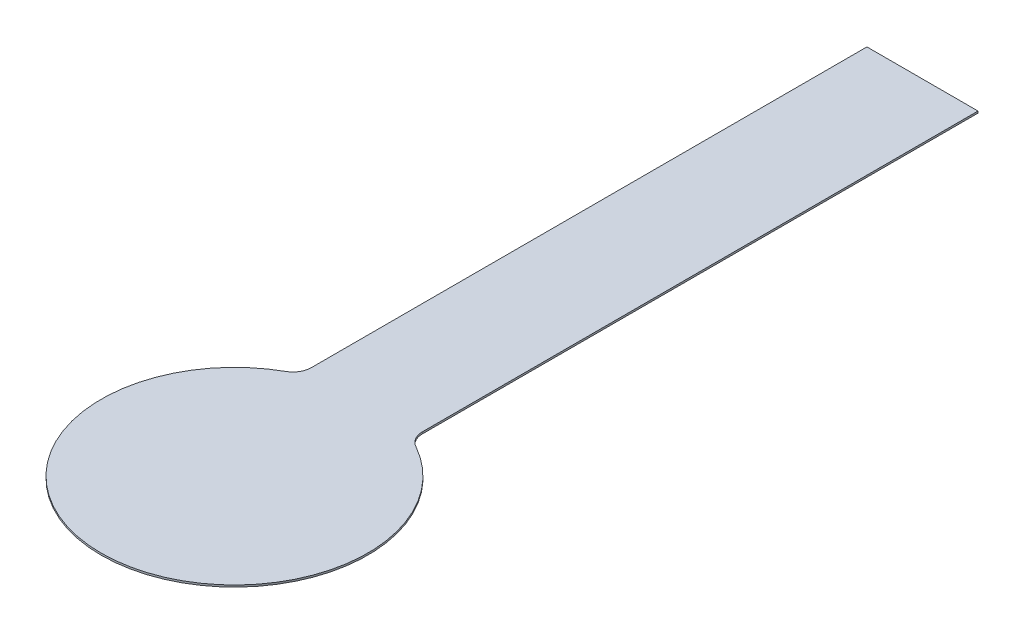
from build123d import *

# Parameters (mm, degrees)
EXTRUDE8_DEPTH = 0.127


with BuildPart() as part:
    # Sketch2 → Extrude8 (new body)
    with BuildSketch(Plane(origin=(0, 0, 0), x_dir=(1, 0, 0), z_dir=(0, 1, 0))):
        with BuildLine():
            Line((-3.8096924, 47.191101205), (3.8096924, 47.191101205))
            Line((3.8096924, 47.191101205), (3.8096924, 9.091101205))
            ThreePointArc((3.8096924, 9.091101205), (3.984331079, 8.448385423), (4.460217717, 7.982430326))
            ThreePointArc((4.460217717, 7.982430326), (0, -9.144), (-4.460217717, 7.982430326))
            ThreePointArc((-4.460217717, 7.982430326), (-3.984331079, 8.448385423), (-3.8096924, 9.091101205))
            Line((-3.8096924, 9.091101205), (-3.8096924, 47.191101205))
        make_face()
    extrude(amount=EXTRUDE8_DEPTH)


solid = part.part
